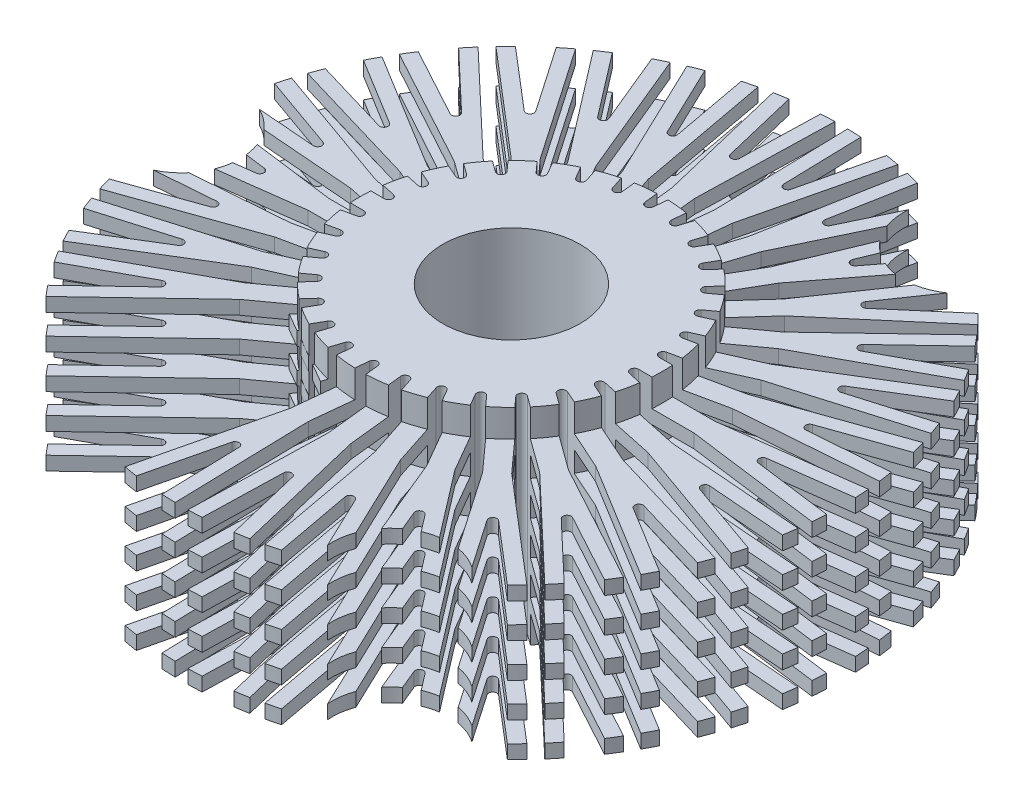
from build123d import *

# Parameters (mm, degrees)
ESQUISSE1_R             = 30
ENL_V_MAT_EXTRU_2_DEPTH = 38.107950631


with BuildPart() as part:
    # Esquisse3 → R_volution1 (revolve)
    with BuildSketch(Plane.XY, mode=Mode.PRIVATE) as r_volution1_sk:
        Polygon((5, 0), (5, 15), (11, 15), (11, 13), (24, 13), (24, 12), (11, 12), (11, 10.5), (24, 10.5), (24, 9.5), (11, 9.5), (11, 8), (24, 8), (24, 7), (11, 7), (11, 5.5), (24, 5.5), (24, 4.5), (11, 4.5), (11, 3), (24, 3), (24, 2), (11, 2), (11, 0), align=None)
    revolve(r_volution1_sk.sketch.rotate(Axis((0, 0, 0), (0, 1, 0)), 90), axis=Axis((0, 0, 0), (0, 1, 0)))

    # Esquisse1 → Enl_v. mat.-Extru.2 (cut, through all)
    with BuildSketch(Plane(origin=(0, 0, 0), x_dir=(1, 0, 0), z_dir=(0, 1, 0))):
        Circle(ESQUISSE1_R)
        with BuildLine():
            Line((9.990082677, -0.75), (14.035518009, -0.75))
            Line((14.035518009, -0.75), (23.912262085, -2.050298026))
            ThreePointArc((23.912262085, -2.050298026), (23.949857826, -1.550583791), (23.977011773, -1.050193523))
            Line((23.977011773, -1.050193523), (18.259231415, -0.297433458))
            ThreePointArc((18.259231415, -0.297433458), (17.998389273, 0), (18.259231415, 0.297433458))
            Line((18.259231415, 0.297433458), (23.977011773, 1.050193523))
            ThreePointArc((23.977011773, 1.050193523), (23.949857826, 1.550583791), (23.912262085, 2.050298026))
            Line((23.912262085, 2.050298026), (14.035518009, 0.75))
            Line((14.035518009, 0.75), (9.990082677, 0.75))
            ThreePointArc((9.990082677, 0.75), (9.691726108, 1.018641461), (9.92770917, 1.34344428))
            Line((9.92770917, 1.34344428), (13.884742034, 2.18453758))
            Line((13.884742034, 2.18453758), (23.816002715, 2.966144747))
            ThreePointArc((23.816002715, 2.966144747), (23.748880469, 3.462755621), (23.67140405, 3.957856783))
            Line((23.67140405, 3.957856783), (17.922063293, 3.505373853))
            ThreePointArc((17.922063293, 3.505373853), (17.605081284, 3.742075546), (17.798383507, 4.0872415))
            Line((17.798383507, 4.0872415), (23.234709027, 6.012345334))
            ThreePointArc((23.234709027, 6.012345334), (23.104111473, 6.49615525), (22.963440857, 6.977132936))
            Line((22.963440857, 6.977132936), (13.572874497, 3.651758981))
            Line((13.572874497, 3.651758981), (9.615841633, 2.810665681))
            ThreePointArc((9.615841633, 2.810665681), (9.268151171, 3.011404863), (9.431447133, 3.378173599))
            Line((9.431447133, 3.378173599), (13.127136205, 5.023600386))
            Line((13.127136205, 5.023600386), (22.678869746, 7.852952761))
            ThreePointArc((22.678869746, 7.852952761), (22.509963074, 8.324755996), (22.331242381, 8.792929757))
            Line((22.331242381, 8.792929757), (16.801615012, 7.154979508))
            ThreePointArc((16.801615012, 7.154979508), (16.442346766, 7.320604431), (16.559660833, 7.698417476))
            Line((16.559660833, 7.698417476), (21.476938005, 10.711728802))
            ThreePointArc((21.476938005, 10.711728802), (21.248604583, 11.157813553), (21.011007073, 11.599033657))
            Line((21.011007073, 11.599033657), (12.51703124, 6.393918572))
            Line((12.51703124, 6.393918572), (8.821342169, 4.748491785))
            ThreePointArc((8.821342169, 4.748491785), (8.439513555, 4.872555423), (8.5229856, 5.265260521))
            Line((8.5229856, 5.265260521), (11.795811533, 7.643107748))
            Line((11.795811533, 7.643107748), (20.550561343, 12.396549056))
            ThreePointArc((20.550561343, 12.396549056), (20.287252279, 12.822924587), (20.015098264, 13.243709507))
            Line((20.015098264, 13.243709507), (14.946855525, 10.491878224))
            ThreePointArc((14.946855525, 10.491878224), (14.561002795, 10.579187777), (14.597201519, 10.973135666))
            Line((14.597201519, 10.973135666), (18.780521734, 14.942958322))
            ThreePointArc((18.780521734, 14.942958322), (18.46443171, 15.331821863), (18.140291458, 15.714000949))
            Line((18.140291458, 15.714000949), (10.914133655, 8.85663324))
            Line((10.914133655, 8.85663324), (7.641307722, 6.478786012))
            ThreePointArc((7.641307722, 6.478786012), (7.242028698, 6.520751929), (7.242028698, 6.922230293))
            Line((7.242028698, 6.922230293), (9.948953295, 9.928574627))
            Line((9.948953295, 9.928574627), (17.524094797, 16.398356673))
            ThreePointArc((17.524094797, 16.398356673), (17.17789121, 16.760669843), (16.824198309, 17.115675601))
            Line((16.824198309, 17.115675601), (12.438846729, 13.370231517))
            ThreePointArc((12.438846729, 13.370231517), (12.04327313, 13.375409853), (11.996774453, 13.768275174))
            Line((11.996774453, 13.768275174), (14.415802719, 17.287983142))
            ThreePointArc((14.415802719, 17.287983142), (13.60926348, 16.851065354), (12.727760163, 16.597383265))
            Line((12.727760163, 16.597383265), (8.834236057, 10.932270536))
            Line((8.834236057, 10.932270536), (6.12731146, 7.925926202))
            ThreePointArc((6.12731146, 7.925926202), (5.728032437, 7.883960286), (5.644560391, 8.276665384))
            Line((5.644560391, 8.276665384), (7.667278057, 11.780115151))
            Line((7.667278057, 11.780115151), (11.353483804, 16.58407201))
            ThreePointArc((11.353483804, 16.58407201), (10.827582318, 16.699522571), (10.320498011, 16.880538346))
            Line((10.320498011, 16.880538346), (9.387200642, 15.664241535))
            ThreePointArc((9.387200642, 15.664241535), (8.999194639, 15.587062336), (8.872030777, 15.961674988))
            Line((8.872030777, 15.961674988), (9.458726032, 17.37808263))
            ThreePointArc((9.458726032, 17.37808263), (9.048419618, 17.726722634), (8.685485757, 18.124441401))
            Line((8.685485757, 18.124441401), (6.368239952, 12.530115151))
            Line((6.368239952, 12.530115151), (4.345522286, 9.026665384))
            ThreePointArc((4.345522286, 9.026665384), (3.963693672, 8.902601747), (3.80039771, 9.269370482))
            Line((3.80039771, 9.269370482), (5.050505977, 13.116808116))
            Line((5.050505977, 13.116808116), (8.009875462, 19.321255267))
            ThreePointArc((8.009875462, 19.321255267), (7.788818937, 20.211500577), (7.763931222, 21.128442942))
            Line((7.763931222, 21.128442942), (5.925288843, 17.273649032))
            ThreePointArc((5.925288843, 17.273649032), (5.56180816, 17.1174854), (5.359536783, 17.457473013))
            Line((5.359536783, 17.457473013), (6.410510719, 23.128020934))
            ThreePointArc((6.410510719, 23.128020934), (5.926220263, 23.256825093), (5.439346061, 23.375489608))
            Line((5.439346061, 23.375489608), (3.623921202, 13.580333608))
            Line((3.623921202, 13.580333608), (2.373812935, 9.732895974))
            ThreePointArc((2.373812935, 9.732895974), (2.026122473, 9.532156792), (1.790139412, 9.856959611))
            Line((1.790139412, 9.856959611), (2.21300255, 13.880233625))
            Line((2.21300255, 13.880233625), (4.538578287, 23.566953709))
            ThreePointArc((4.538578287, 23.566953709), (4.045531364, 23.656577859), (3.550720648, 23.735888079))
            Line((3.550720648, 23.735888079), (2.204413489, 18.128115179))
            ThreePointArc((2.204413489, 18.128115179), (1.881343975, 17.899792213), (1.612805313, 18.190295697))
            Line((1.612805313, 18.190295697), (1.461839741, 23.955438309))
            ThreePointArc((1.461839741, 23.955438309), (0.961352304, 23.98073814), (0.46044573, 23.995582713))
            Line((0.46044573, 23.995582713), (0.721219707, 14.03702632))
            Line((0.721219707, 14.03702632), (0.298356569, 10.013752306))
            ThreePointArc((0.298356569, 10.013752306), (0, 9.745110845), (-0.298356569, 10.013752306))
            Line((-0.298356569, 10.013752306), (-0.721219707, 14.03702632))
            Line((-0.721219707, 14.03702632), (-0.46044573, 23.995582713))
            ThreePointArc((-0.46044573, 23.995582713), (-0.961352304, 23.98073814), (-1.461839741, 23.955438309))
            Line((-1.461839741, 23.955438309), (-1.612805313, 18.190295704))
            ThreePointArc((-1.612805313, 18.190295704), (-1.881343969, 17.899792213), (-2.204413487, 18.128115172))
            Line((-2.204413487, 18.128115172), (-3.550720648, 23.735888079))
            ThreePointArc((-3.550720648, 23.735888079), (-4.045531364, 23.656577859), (-4.538578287, 23.566953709))
            Line((-4.538578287, 23.566953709), (-2.21300255, 13.880233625))
            Line((-2.21300255, 13.880233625), (-1.790139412, 9.856959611))
            ThreePointArc((-1.790139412, 9.856959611), (-2.026122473, 9.532156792), (-2.373812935, 9.732895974))
            Line((-2.373812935, 9.732895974), (-3.623921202, 13.580333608))
            Line((-3.623921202, 13.580333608), (-5.439346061, 23.375489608))
            ThreePointArc((-5.439346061, 23.375489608), (-5.926220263, 23.256825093), (-6.410510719, 23.128020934))
            Line((-6.410510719, 23.128020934), (-5.359536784, 17.457473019))
            ThreePointArc((-5.359536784, 17.457473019), (-5.561808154, 17.117485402), (-5.92528884, 17.273649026))
            Line((-5.92528884, 17.273649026), (-8.408097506, 22.478965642))
            ThreePointArc((-8.408097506, 22.478965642), (-8.875605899, 22.298511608), (-9.339244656, 22.108335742))
            Line((-9.339244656, 22.108335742), (-5.050505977, 13.116808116))
            Line((-5.050505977, 13.116808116), (-3.80039771, 9.269370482))
            ThreePointArc((-3.80039771, 9.269370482), (-3.963693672, 8.902601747), (-4.345522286, 9.026665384))
            Line((-4.345522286, 9.026665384), (-6.368239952, 12.530115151))
            Line((-6.368239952, 12.530115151), (-10.180520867, 21.73377544))
            ThreePointArc((-10.180520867, 21.73377544), (-10.63208396, 21.51647719), (-11.079011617, 21.289798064))
            Line((-11.079011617, 21.289798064), (-8.872030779, 15.961674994))
            ThreePointArc((-8.872030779, 15.961674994), (-8.999194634, 15.587062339), (-9.387200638, 15.66424153))
            Line((-9.387200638, 15.66424153), (-12.898000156, 20.239604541))
            ThreePointArc((-12.898000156, 20.239604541), (-13.317773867, 19.965893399), (-13.731741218, 19.683477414))
            Line((-13.731741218, 19.683477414), (-7.667278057, 11.780115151))
            Line((-7.667278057, 11.780115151), (-5.644560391, 8.276665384))
            ThreePointArc((-5.644560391, 8.276665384), (-5.728032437, 7.883960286), (-6.12731146, 7.925926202))
            Line((-6.12731146, 7.925926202), (-8.834236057, 10.932270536))
            Line((-8.834236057, 10.932270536), (-14.47675806, 19.142190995))
            ThreePointArc((-14.47675806, 19.142190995), (-14.873274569, 18.835755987), (-15.263306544, 18.521108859))
            Line((-15.263306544, 18.521108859), (-11.996774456, 13.768275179))
            ThreePointArc((-11.996774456, 13.768275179), (-12.043273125, 13.375409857), (-12.438846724, 13.370231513))
            Line((-12.438846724, 13.370231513), (-16.824198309, 17.115675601))
            ThreePointArc((-16.824198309, 17.115675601), (-17.17789121, 16.760669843), (-17.524094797, 16.398356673))
            Line((-17.524094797, 16.398356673), (-9.948953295, 9.928574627))
            Line((-9.948953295, 9.928574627), (-7.242028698, 6.922230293))
            ThreePointArc((-7.242028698, 6.922230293), (-7.242028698, 6.520751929), (-7.641307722, 6.478786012))
            Line((-7.641307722, 6.478786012), (-10.914133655, 8.85663324))
            Line((-10.914133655, 8.85663324), (-18.140291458, 15.714000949))
            ThreePointArc((-18.140291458, 15.714000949), (-18.46443171, 15.331821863), (-18.780521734, 14.942958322))
            Line((-18.780521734, 14.942958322), (-14.597201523, 10.973135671))
            ThreePointArc((-14.597201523, 10.973135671), (-14.561002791, 10.579187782), (-14.946855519, 10.491878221))
            Line((-14.946855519, 10.491878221), (-20.015098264, 13.243709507))
            ThreePointArc((-20.015098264, 13.243709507), (-20.287252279, 12.822924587), (-20.550561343, 12.396549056))
            Line((-20.550561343, 12.396549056), (-11.795811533, 7.643107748))
            Line((-11.795811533, 7.643107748), (-8.5229856, 5.265260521))
            ThreePointArc((-8.5229856, 5.265260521), (-8.439513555, 4.872555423), (-8.821342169, 4.748491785))
            Line((-8.821342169, 4.748491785), (-12.51703124, 6.393918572))
            Line((-12.51703124, 6.393918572), (-21.011007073, 11.599033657))
            ThreePointArc((-21.011007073, 11.599033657), (-21.248604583, 11.157813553), (-21.476938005, 10.711728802))
            Line((-21.476938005, 10.711728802), (-16.559660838, 7.698417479))
            ThreePointArc((-16.559660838, 7.698417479), (-16.442346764, 7.320604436), (-16.801615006, 7.154979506))
            Line((-16.801615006, 7.154979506), (-22.331242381, 8.792929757))
            ThreePointArc((-22.331242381, 8.792929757), (-22.509963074, 8.324755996), (-22.678869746, 7.852952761))
            Line((-22.678869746, 7.852952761), (-13.127136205, 5.023600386))
            Line((-13.127136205, 5.023600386), (-9.431447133, 3.378173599))
            ThreePointArc((-9.431447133, 3.378173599), (-9.268151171, 3.011404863), (-9.615841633, 2.810665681))
            Line((-9.615841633, 2.810665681), (-13.572874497, 3.651758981))
            Line((-13.572874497, 3.651758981), (-22.963440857, 6.977132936))
            ThreePointArc((-22.963440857, 6.977132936), (-23.104111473, 6.49615525), (-23.234709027, 6.012345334))
            Line((-23.234709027, 6.012345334), (-17.798383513, 4.087241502))
            ThreePointArc((-17.798383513, 4.087241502), (-17.605081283, 3.742075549), (-17.922063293, 3.505373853))
            Line((-17.922063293, 3.505373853), (-22.179733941, 3.8404598))
            ThreePointArc((-22.179733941, 3.8404598), (-21.398082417, 3.360435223), (-20.737635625, 2.723872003))
            Line((-20.737635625, 2.723872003), (-13.884742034, 2.18453758))
            Line((-13.884742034, 2.18453758), (-9.92770917, 1.34344428))
            ThreePointArc((-9.92770917, 1.34344428), (-9.691726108, 1.018641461), (-9.990082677, 0.75))
            Line((-9.990082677, 0.75), (-14.035518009, 0.75))
            Line((-14.035518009, 0.75), (-20.038969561, 1.540369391))
            ThreePointArc((-20.038969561, 1.540369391), (-19.876001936, 1.027200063), (-19.779224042, 0.497544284))
            Line((-19.779224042, 0.497544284), (-18.259231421, 0.297433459))
            ThreePointArc((-18.259231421, 0.297433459), (-17.998389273, 3e-09), (-18.259231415, -0.297433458))
            Line((-18.259231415, -0.297433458), (-19.779224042, -0.497544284))
            ThreePointArc((-19.779224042, -0.497544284), (-19.876001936, -1.027200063), (-20.038969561, -1.540369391))
            Line((-20.038969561, -1.540369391), (-14.035518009, -0.75))
            Line((-14.035518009, -0.75), (-9.990082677, -0.75))
            ThreePointArc((-9.990082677, -0.75), (-9.691726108, -1.018641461), (-9.92770917, -1.34344428))
            Line((-9.92770917, -1.34344428), (-13.884742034, -2.18453758))
            Line((-13.884742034, -2.18453758), (-20.737635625, -2.723872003))
            ThreePointArc((-20.737635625, -2.723872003), (-21.398082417, -3.360435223), (-22.179733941, -3.8404598))
            Line((-22.179733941, -3.8404598), (-17.9220633, -3.505373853))
            ThreePointArc((-17.9220633, -3.505373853), (-17.605081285, -3.742075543), (-17.798383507, -4.0872415))
            Line((-17.798383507, -4.0872415), (-23.234709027, -6.012345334))
            ThreePointArc((-23.234709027, -6.012345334), (-23.104111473, -6.49615525), (-22.963440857, -6.977132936))
            Line((-22.963440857, -6.977132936), (-13.572874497, -3.651758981))
            Line((-13.572874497, -3.651758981), (-9.615841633, -2.810665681))
            ThreePointArc((-9.615841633, -2.810665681), (-9.268151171, -3.011404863), (-9.431447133, -3.378173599))
            Line((-9.431447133, -3.378173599), (-13.127136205, -5.023600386))
            Line((-13.127136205, -5.023600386), (-22.678869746, -7.852952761))
            ThreePointArc((-22.678869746, -7.852952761), (-22.509963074, -8.324755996), (-22.331242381, -8.792929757))
            Line((-22.331242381, -8.792929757), (-16.801615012, -7.154979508))
            ThreePointArc((-16.801615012, -7.154979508), (-16.442346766, -7.320604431), (-16.559660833, -7.698417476))
            Line((-16.559660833, -7.698417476), (-21.476938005, -10.711728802))
            ThreePointArc((-21.476938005, -10.711728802), (-21.248604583, -11.157813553), (-21.011007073, -11.599033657))
            Line((-21.011007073, -11.599033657), (-12.51703124, -6.393918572))
            Line((-12.51703124, -6.393918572), (-8.821342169, -4.748491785))
            ThreePointArc((-8.821342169, -4.748491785), (-8.439513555, -4.872555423), (-8.5229856, -5.265260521))
            Line((-8.5229856, -5.265260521), (-11.795811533, -7.643107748))
            Line((-11.795811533, -7.643107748), (-20.550561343, -12.396549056))
            ThreePointArc((-20.550561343, -12.396549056), (-20.287252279, -12.822924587), (-20.015098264, -13.243709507))
            Line((-20.015098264, -13.243709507), (-14.946855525, -10.491878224))
            ThreePointArc((-14.946855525, -10.491878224), (-14.561002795, -10.579187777), (-14.597201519, -10.973135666))
            Line((-14.597201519, -10.973135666), (-18.780521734, -14.942958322))
            ThreePointArc((-18.780521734, -14.942958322), (-18.46443171, -15.331821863), (-18.140291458, -15.714000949))
            Line((-18.140291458, -15.714000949), (-10.914133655, -8.85663324))
            Line((-10.914133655, -8.85663324), (-7.641307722, -6.478786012))
            ThreePointArc((-7.641307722, -6.478786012), (-7.242028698, -6.520751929), (-7.242028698, -6.922230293))
            Line((-7.242028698, -6.922230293), (-8.188902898, -7.973840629))
            Line((-8.188902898, -7.973840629), (-6.860843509, -8.740596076))
            Line((-6.860843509, -8.740596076), (-6.12731146, -7.925926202))
            ThreePointArc((-6.12731146, -7.925926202), (-5.728032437, -7.883960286), (-5.644560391, -8.276665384))
            Line((-5.644560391, -8.276665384), (-6.149519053, -9.151279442))
            Line((-6.149519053, -9.151279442), (-4.850480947, -9.901279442))
            Line((-4.850480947, -9.901279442), (-4.345522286, -9.026665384))
            ThreePointArc((-4.345522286, -9.026665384), (-3.963693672, -8.902601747), (-3.80039771, -9.269370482))
            Line((-3.80039771, -9.269370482), (-4.139156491, -10.311962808))
            Line((-4.139156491, -10.311962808), (-2.811097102, -11.078718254))
            Line((-2.811097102, -11.078718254), (-2.373812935, -9.732895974))
            ThreePointArc((-2.373812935, -9.732895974), (-2.026122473, -9.532156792), (-1.790139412, -9.856959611))
            Line((-1.790139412, -9.856959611), (-2.21300255, -13.880233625))
            Line((-2.21300255, -13.880233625), (-4.538578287, -23.566953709))
            ThreePointArc((-4.538578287, -23.566953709), (-4.045531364, -23.656577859), (-3.550720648, -23.735888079))
            Line((-3.550720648, -23.735888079), (-2.204413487, -18.128115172))
            ThreePointArc((-2.204413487, -18.128115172), (-1.881343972, -17.899792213), (-1.612805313, -18.190295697))
            Line((-1.612805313, -18.190295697), (-1.461839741, -23.955438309))
            ThreePointArc((-1.461839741, -23.955438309), (-0.961352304, -23.98073814), (-0.46044573, -23.995582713))
            Line((-0.46044573, -23.995582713), (-0.721219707, -14.03702632))
            Line((-0.721219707, -14.03702632), (-0.298356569, -10.013752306))
            ThreePointArc((-0.298356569, -10.013752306), (0, -9.745110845), (0.298356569, -10.013752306))
            Line((0.298356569, -10.013752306), (0.721219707, -14.03702632))
            Line((0.721219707, -14.03702632), (0.46044573, -23.995582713))
            ThreePointArc((0.46044573, -23.995582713), (0.961352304, -23.98073814), (1.461839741, -23.955438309))
            Line((1.461839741, -23.955438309), (1.612805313, -18.190295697))
            ThreePointArc((1.612805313, -18.190295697), (1.881343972, -17.899792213), (2.204413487, -18.128115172))
            Line((2.204413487, -18.128115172), (3.550720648, -23.735888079))
            ThreePointArc((3.550720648, -23.735888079), (4.045531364, -23.656577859), (4.538578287, -23.566953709))
            Line((4.538578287, -23.566953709), (2.21300255, -13.880233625))
            Line((2.21300255, -13.880233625), (1.790139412, -9.856959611))
            ThreePointArc((1.790139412, -9.856959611), (2.026122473, -9.532156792), (2.373812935, -9.732895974))
            Line((2.373812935, -9.732895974), (3.623921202, -13.580333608))
            Line((3.623921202, -13.580333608), (5.439346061, -23.375489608))
            ThreePointArc((5.439346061, -23.375489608), (5.926220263, -23.256825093), (6.410510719, -23.128020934))
            Line((6.410510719, -23.128020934), (5.359536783, -17.457473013))
            ThreePointArc((5.359536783, -17.457473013), (5.561808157, -17.117485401), (5.92528884, -17.273649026))
            Line((5.92528884, -17.273649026), (7.763931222, -21.128442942))
            ThreePointArc((7.763931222, -21.128442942), (7.788818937, -20.211500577), (8.009875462, -19.321255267))
            Line((8.009875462, -19.321255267), (5.050505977, -13.116808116))
            Line((5.050505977, -13.116808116), (3.80039771, -9.269370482))
            ThreePointArc((3.80039771, -9.269370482), (3.963693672, -8.902601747), (4.345522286, -9.026665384))
            Line((4.345522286, -9.026665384), (6.368239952, -12.530115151))
            Line((6.368239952, -12.530115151), (8.685485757, -18.124441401))
            ThreePointArc((8.685485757, -18.124441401), (9.048419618, -17.726722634), (9.458726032, -17.37808263))
            Line((9.458726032, -17.37808263), (8.872030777, -15.961674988))
            ThreePointArc((8.872030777, -15.961674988), (8.999194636, -15.587062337), (9.387200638, -15.66424153))
            Line((9.387200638, -15.66424153), (10.320498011, -16.880538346))
            ThreePointArc((10.320498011, -16.880538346), (10.827582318, -16.699522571), (11.353483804, -16.58407201))
            Line((11.353483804, -16.58407201), (7.667278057, -11.780115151))
            Line((7.667278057, -11.780115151), (5.644560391, -8.276665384))
            ThreePointArc((5.644560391, -8.276665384), (5.728032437, -7.883960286), (6.12731146, -7.925926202))
            Line((6.12731146, -7.925926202), (8.834236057, -10.932270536))
            Line((8.834236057, -10.932270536), (12.727760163, -16.597383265))
            ThreePointArc((12.727760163, -16.597383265), (13.60926348, -16.851065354), (14.415802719, -17.287983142))
            Line((14.415802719, -17.287983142), (11.996774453, -13.768275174))
            ThreePointArc((11.996774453, -13.768275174), (12.043273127, -13.375409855), (12.438846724, -13.370231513))
            Line((12.438846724, -13.370231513), (16.824198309, -17.115675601))
            ThreePointArc((16.824198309, -17.115675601), (17.17789121, -16.760669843), (17.524094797, -16.398356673))
            Line((17.524094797, -16.398356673), (9.948953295, -9.928574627))
            Line((9.948953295, -9.928574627), (7.242028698, -6.922230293))
            ThreePointArc((7.242028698, -6.922230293), (7.242028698, -6.520751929), (7.641307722, -6.478786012))
            Line((7.641307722, -6.478786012), (10.914133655, -8.85663324))
            Line((10.914133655, -8.85663324), (18.140291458, -15.714000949))
            ThreePointArc((18.140291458, -15.714000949), (18.46443171, -15.331821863), (18.780521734, -14.942958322))
            Line((18.780521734, -14.942958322), (14.597201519, -10.973135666))
            ThreePointArc((14.597201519, -10.973135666), (14.561002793, -10.579187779), (14.946855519, -10.491878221))
            Line((14.946855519, -10.491878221), (20.015098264, -13.243709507))
            ThreePointArc((20.015098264, -13.243709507), (20.287252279, -12.822924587), (20.550561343, -12.396549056))
            Line((20.550561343, -12.396549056), (11.795811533, -7.643107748))
            Line((11.795811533, -7.643107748), (8.5229856, -5.265260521))
            ThreePointArc((8.5229856, -5.265260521), (8.439513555, -4.872555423), (8.821342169, -4.748491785))
            Line((8.821342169, -4.748491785), (12.51703124, -6.393918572))
            Line((12.51703124, -6.393918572), (21.011007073, -11.599033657))
            ThreePointArc((21.011007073, -11.599033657), (21.248604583, -11.157813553), (21.476938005, -10.711728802))
            Line((21.476938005, -10.711728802), (16.559660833, -7.698417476))
            ThreePointArc((16.559660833, -7.698417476), (16.442346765, -7.320604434), (16.801615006, -7.154979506))
            Line((16.801615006, -7.154979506), (22.331242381, -8.792929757))
            ThreePointArc((22.331242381, -8.792929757), (22.509963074, -8.324755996), (22.678869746, -7.852952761))
            Line((22.678869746, -7.852952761), (13.127136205, -5.023600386))
            Line((13.127136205, -5.023600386), (9.431447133, -3.378173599))
            ThreePointArc((9.431447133, -3.378173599), (9.268151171, -3.011404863), (9.615841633, -2.810665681))
            Line((9.615841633, -2.810665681), (13.572874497, -3.651758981))
            Line((13.572874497, -3.651758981), (22.963440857, -6.977132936))
            ThreePointArc((22.963440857, -6.977132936), (23.104111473, -6.49615525), (23.234709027, -6.012345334))
            Line((23.234709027, -6.012345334), (17.798383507, -4.0872415))
            ThreePointArc((17.798383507, -4.0872415), (17.605081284, -3.742075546), (17.922063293, -3.505373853))
            Line((17.922063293, -3.505373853), (23.67140405, -3.957856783))
            ThreePointArc((23.67140405, -3.957856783), (23.748880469, -3.462755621), (23.816002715, -2.966144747))
            Line((23.816002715, -2.966144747), (13.884742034, -2.18453758))
            Line((13.884742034, -2.18453758), (9.92770917, -1.34344428))
            ThreePointArc((9.92770917, -1.34344428), (9.691726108, -1.018641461), (9.990082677, -0.75))
        make_face(mode=Mode.SUBTRACT)
    extrude(amount=ENL_V_MAT_EXTRU_2_DEPTH, mode=Mode.SUBTRACT)


solid = part.part
